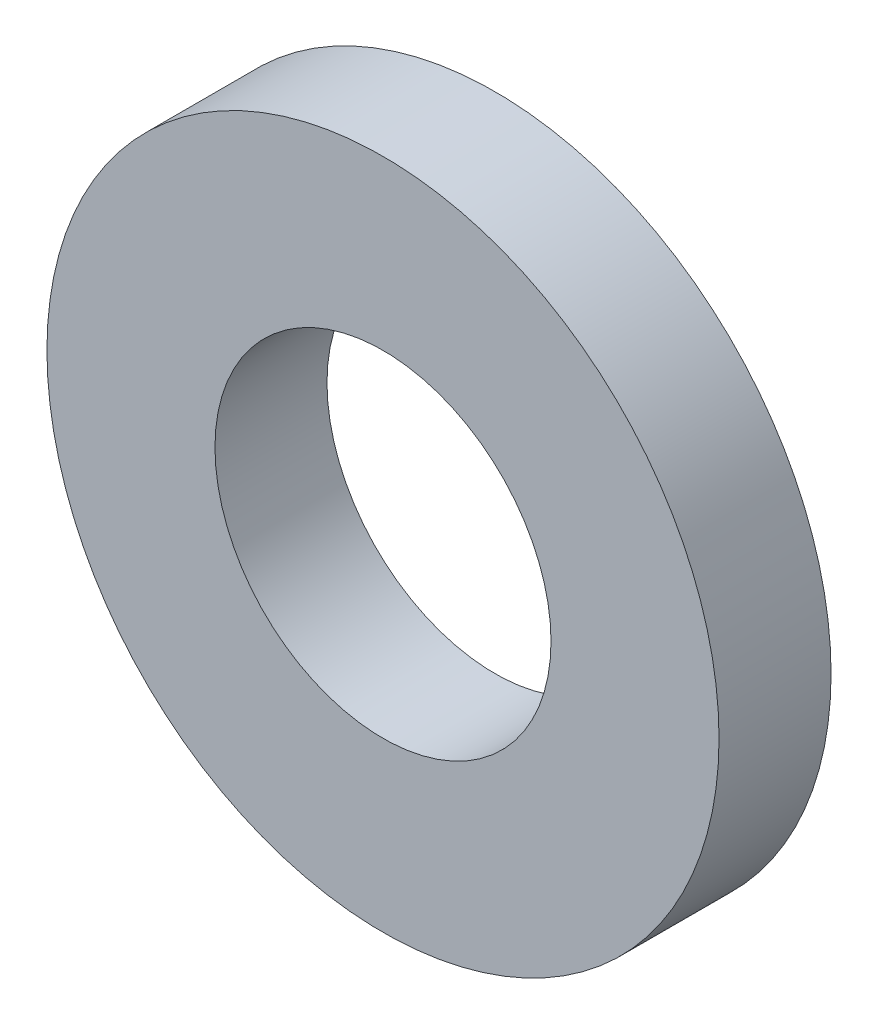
from build123d import *

# Parameters (mm, degrees)
SKETCH_1_R      = 9
SKETCH_1_R_2    = 4.5
EXTRUDE_1_DEPTH = 3


with BuildPart() as part:
    # Sketch 1 → Extrude 1 (new body)
    with BuildSketch(Plane.XY):
        Circle(SKETCH_1_R)
        Circle(SKETCH_1_R_2, mode=Mode.SUBTRACT)
    extrude(amount=EXTRUDE_1_DEPTH)


solid = part.part
